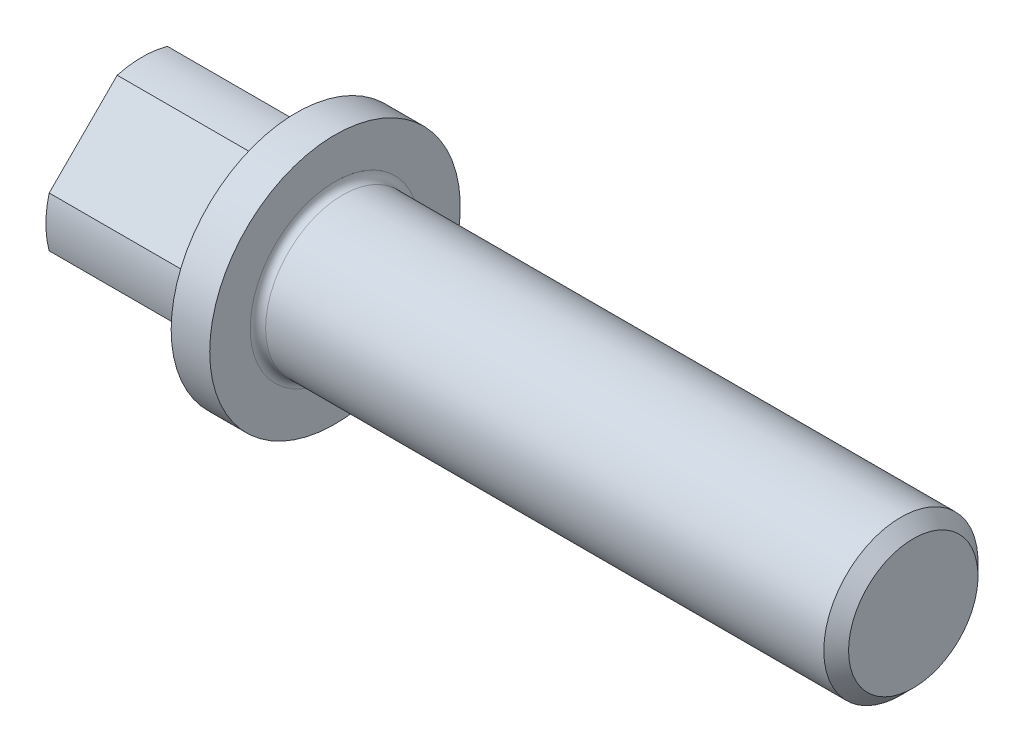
from build123d import *

# Parameters (mm, degrees)
FILLET1_R           = 0.6
FILLET2_R           = 0.6
SQRDRVSKE_OUTSIDE_W = 34.706
SQRDRVSKE_OUTSIDE_H = 34.706
SQUARE_DRIVE_DEPTH  = 12


with BuildPart() as part:
    # BodySke → Base-Revolve (revolve)
    with BuildSketch(Plane.XY, mode=Mode.PRIVATE) as base_revolve_sk:
        Polygon((0, 0), (0, 9.75), (15, 9.75), (15, 6), (59.036, 6), (60, 5.036), (60, 0), align=None)
    revolve(base_revolve_sk.sketch.rotate(Axis((-31.75, 0, 0), (1, 0, 0)), 90), axis=Axis((-31.75, 0, 0), (1, 0, 0)))

    # Fillet1
    fillet1_edges = [part.edges().sort_by_distance(p)[0] for p in [
        (15, 0, -6),
    ]]
    fillet(fillet1_edges, radius=FILLET1_R)

    # Fillet2
    fillet2_edges = [part.edges().sort_by_distance(p)[0] for p in [
        (0, 0, -9.75),
    ]]
    fillet(fillet2_edges, radius=FILLET2_R)

    # SqrDrvSke outside → Square drive (cut)
    with BuildSketch(Plane(origin=(0, 0, 0), x_dir=(0, 0, -1), z_dir=(1, 0, 0))):
        Rectangle(SQRDRVSKE_OUTSIDE_W, SQRDRVSKE_OUTSIDE_H)
        with BuildLine():
            Line((1.950442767, -7.241945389), (7.241945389, -1.950442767))
            ThreePointArc((7.241945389, -1.950442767), (7.5, 0), (7.241945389, 1.950442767))
            Line((7.241945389, 1.950442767), (1.950442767, 7.241945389))
            ThreePointArc((1.950442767, 7.241945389), (0, 7.5), (-1.950442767, 7.241945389))
            Line((-1.950442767, 7.241945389), (-7.241945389, 1.950442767))
            ThreePointArc((-7.241945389, 1.950442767), (-7.5, 0), (-7.241945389, -1.950442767))
            Line((-7.241945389, -1.950442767), (-1.950442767, -7.241945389))
            ThreePointArc((-1.950442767, -7.241945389), (0, -7.5), (1.950442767, -7.241945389))
        make_face(mode=Mode.SUBTRACT)
    extrude(amount=SQUARE_DRIVE_DEPTH, mode=Mode.SUBTRACT)


solid = part.part
